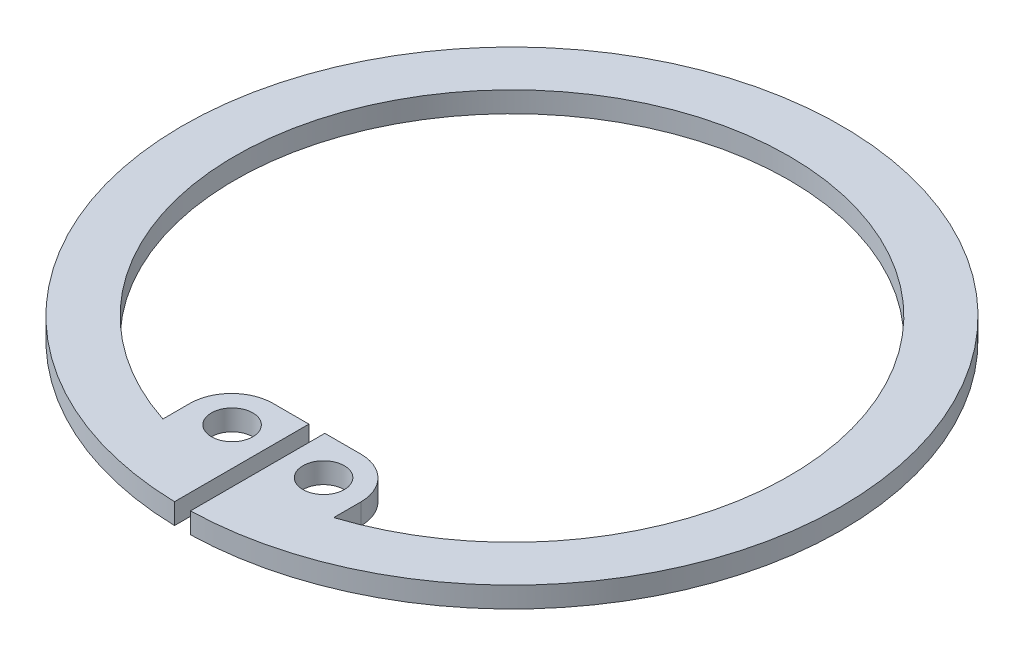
from build123d import *

# Parameters (mm, degrees)
ESQUISSE1_R      = 3
EXTRUSION2_DEPTH = 3
CONG_2_R         = 6


with BuildPart() as part:
    # Esquisse1 → Extrusion2 (new body)
    with BuildSketch(Plane(origin=(0, 0, 0), x_dir=(1, 0, 0), z_dir=(0, 1, 0))):
        with BuildLine():
            Line((-1.155241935, -47.736023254), (-1.155241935, -28.264856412))
            Line((-1.155241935, -28.264856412), (-12.371546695, -28.264856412))
            Line((-12.371546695, -28.264856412), (-12.371546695, -38.196430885))
            ThreePointArc((-12.371546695, -38.196430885), (0, 40.15), (12.371546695, -38.196430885))
            Line((12.371546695, -38.196430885), (12.371546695, -28.264856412))
            Line((12.371546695, -28.264856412), (1.155241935, -28.264856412))
            Line((1.155241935, -28.264856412), (1.155241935, -47.736023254))
            ThreePointArc((1.155241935, -47.736023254), (0, 47.75), (-1.155241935, -47.736023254))
        make_face()
        with Locations(Location((-6.628151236, -33.917086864, 0), (0, 0, 270))):
            Circle(ESQUISSE1_R, mode=Mode.SUBTRACT)
        with Locations(Location((6.628151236, -33.917086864, 0), (0, 0, 90))):
            Circle(ESQUISSE1_R, mode=Mode.SUBTRACT)
    extrude(amount=EXTRUSION2_DEPTH)

    # Cong_2
    cong_2_edges = [part.edges().sort_by_distance(p)[0] for p in [
        (-12.371546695, 1.5, 28.264856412),
        (12.371546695, 1.5, 28.264856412),
    ]]
    fillet(cong_2_edges, radius=CONG_2_R)


solid = part.part
